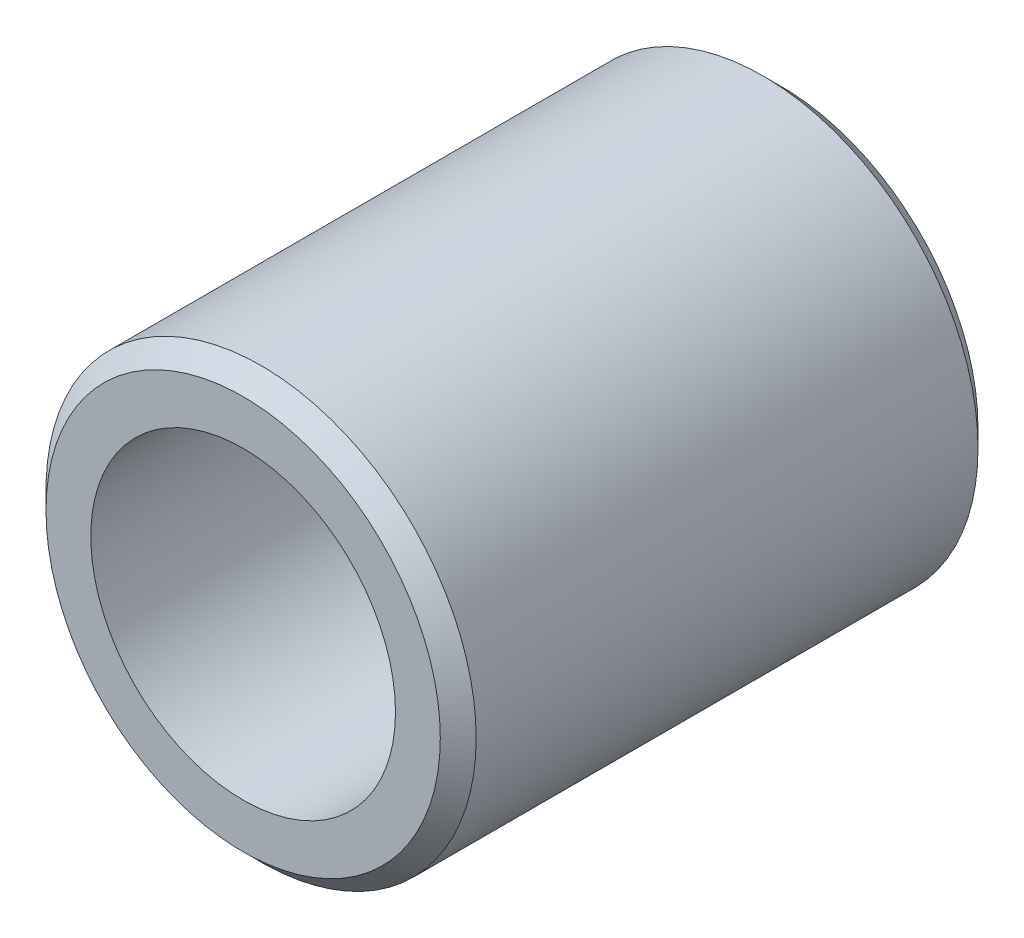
from build123d import *

# Parameters (mm, degrees)
ESQUISSE1_R        = 6
ESQUISSE1_R_2      = 4.25
BOSS_EXTRU_1_DEPTH = 15
CHANFREIN1_SIZE    = 0.5


with BuildPart() as part:
    # Esquisse1 → Boss.-Extru.1 (new body)
    with BuildSketch(Plane.XY):
        Circle(ESQUISSE1_R)
        Circle(ESQUISSE1_R_2, mode=Mode.SUBTRACT)
    extrude(amount=BOSS_EXTRU_1_DEPTH)

    # Chanfrein1
    chanfrein1_edges = [part.edges().sort_by_distance(p)[0] for p in [
        (-6, 0, 0),
        (-6, 0, 15),
    ]]
    chamfer(chanfrein1_edges, length=CHANFREIN1_SIZE)


solid = part.part
